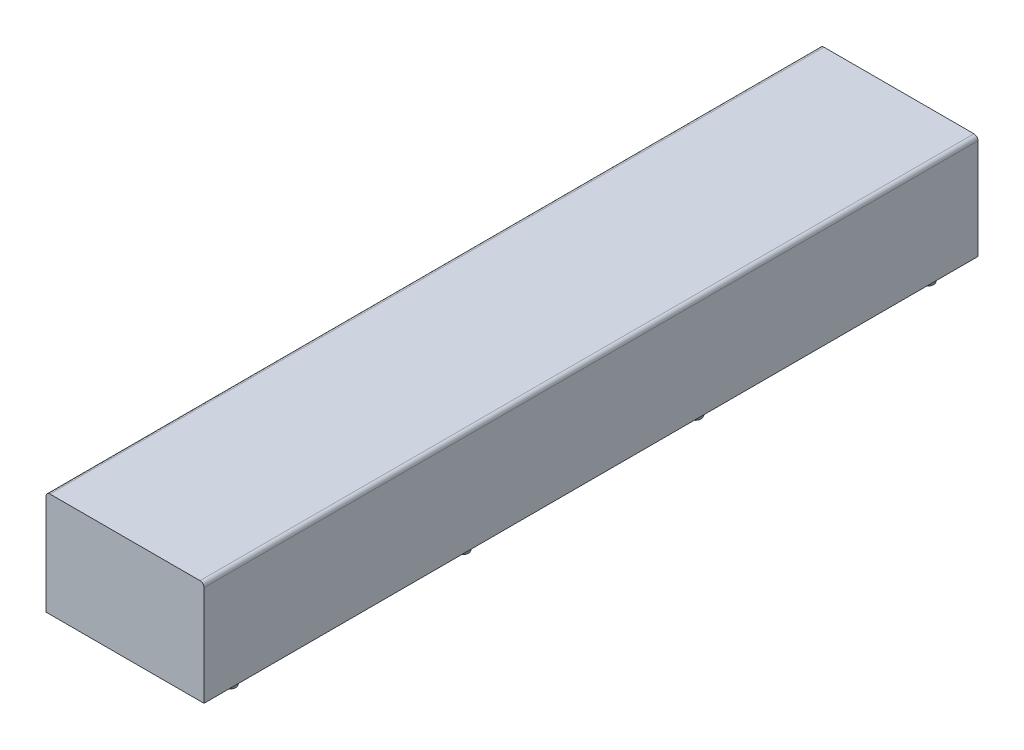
ISO-10303-21;
HEADER;
FILE_DESCRIPTION(('STEP AP214'),'2;1');
FILE_NAME('part.step','',(''),(''),'','','');
FILE_SCHEMA(('AUTOMOTIVE_DESIGN { 1 0 10303 214 1 1 1 1 }'));
ENDSEC;
DATA;
#1=APPLICATION_CONTEXT('core data for automotive mechanical design processes');
#2=APPLICATION_PROTOCOL_DEFINITION('international standard','automotive_design',2000,#1);
#3=PRODUCT_CONTEXT('',#1,'mechanical');
#4=PRODUCT('Part','Part','',(#3));
#5=PRODUCT_RELATED_PRODUCT_CATEGORY('part','',(#4));
#6=PRODUCT_DEFINITION_FORMATION('','',#4);
#7=PRODUCT_DEFINITION_CONTEXT('part definition',#1,'design');
#8=PRODUCT_DEFINITION('design','',#6,#7);
#9=PRODUCT_DEFINITION_SHAPE('','',#8);
#10=(LENGTH_UNIT() NAMED_UNIT(*) SI_UNIT(.MILLI.,.METRE.));
#11=(NAMED_UNIT(*) PLANE_ANGLE_UNIT() SI_UNIT($,.RADIAN.));
#12=(NAMED_UNIT(*) SI_UNIT($,.STERADIAN.) SOLID_ANGLE_UNIT());
#13=UNCERTAINTY_MEASURE_WITH_UNIT(LENGTH_MEASURE(1.E-05),#10,'distance_accuracy_value','');
#14=(GEOMETRIC_REPRESENTATION_CONTEXT(3) GLOBAL_UNCERTAINTY_ASSIGNED_CONTEXT((#13)) GLOBAL_UNIT_ASSIGNED_CONTEXT((#10,
#11,#12)) REPRESENTATION_CONTEXT('',''));
#15=CARTESIAN_POINT('',(0.,0.,0.));
#16=DIRECTION('',(0.,0.,1.));
#17=DIRECTION('',(1.,0.,0.));
#18=AXIS2_PLACEMENT_3D('',#15,#16,#17);
#19=CARTESIAN_POINT('',(-85.0000000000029,-130.,73.1821378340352));
#20=DIRECTION('',(0.,1.,0.));
#21=DIRECTION('',(0.,0.,-1.));
#22=AXIS2_PLACEMENT_3D('',#19,#20,#21);
#23=CONICAL_SURFACE('',#22,10.,0.349065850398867);
#24=CARTESIAN_POINT('',(-85.0000000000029,-140.,73.1821378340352));
#25=DIRECTION('',(0.,-1.,0.));
#26=DIRECTION('',(0.,0.,-1.));
#27=AXIS2_PLACEMENT_3D('',#24,#25,#26);
#28=CIRCLE('',#27,6.36029765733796);
#29=CARTESIAN_POINT('',(-85.0000000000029,-140.,66.8218401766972));
#30=VERTEX_POINT('',#29);
#31=EDGE_CURVE('E11',#30,#30,#28,.T.);
#32=ORIENTED_EDGE('',*,*,#31,.F.);
#33=EDGE_LOOP('',(#32));
#34=FACE_BOUND('',#33,.T.);
#35=CARTESIAN_POINT('',(-85.0000000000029,-130.,73.1821378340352));
#36=DIRECTION('',(0.,-1.,0.));
#37=DIRECTION('',(0.,0.,-1.));
#38=AXIS2_PLACEMENT_3D('',#35,#36,#37);
#39=CIRCLE('',#38,10.);
#40=CARTESIAN_POINT('',(-85.0000000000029,-130.,63.1821378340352));
#41=VERTEX_POINT('',#40);
#42=EDGE_CURVE('E48',#41,#41,#39,.T.);
#43=ORIENTED_EDGE('',*,*,#42,.T.);
#44=EDGE_LOOP('',(#43));
#45=FACE_BOUND('',#44,.T.);
#46=ADVANCED_FACE('F42',(#34,#45),#23,.T.);
#47=CARTESIAN_POINT('',(-85.0000000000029,-140.,73.1821378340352));
#48=DIRECTION('',(0.,-1.,0.));
#49=DIRECTION('',(0.,0.,-1.));
#50=AXIS2_PLACEMENT_3D('',#47,#48,#49);
#51=PLANE('',#50);
#52=ORIENTED_EDGE('',*,*,#31,.T.);
#53=EDGE_LOOP('',(#52));
#54=FACE_BOUND('',#53,.T.);
#55=ADVANCED_FACE('F57',(#54),#51,.T.);
#56=CARTESIAN_POINT('',(-85.0000000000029,-130.,73.1821378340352));
#57=DIRECTION('',(0.,-1.,0.));
#58=DIRECTION('',(0.,0.,-1.));
#59=AXIS2_PLACEMENT_3D('',#56,#57,#58);
#60=PLANE('',#59);
#61=ORIENTED_EDGE('',*,*,#42,.F.);
#62=EDGE_LOOP('',(#61));
#63=FACE_BOUND('',#62,.T.);
#64=ADVANCED_FACE('F55',(#63),#60,.F.);
#65=CLOSED_SHELL('',(#46,#55,#64));
#66=MANIFOLD_SOLID_BREP('B2',#65);
#67=CARTESIAN_POINT('',(84.9999999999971,-130.,73.1821378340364));
#68=DIRECTION('',(0.,1.,0.));
#69=DIRECTION('',(0.,0.,-1.));
#70=AXIS2_PLACEMENT_3D('',#67,#68,#69);
#71=CONICAL_SURFACE('',#70,10.,0.349065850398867);
#72=CARTESIAN_POINT('',(84.9999999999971,-140.,73.1821378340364));
#73=DIRECTION('',(0.,-1.,0.));
#74=DIRECTION('',(0.,0.,-1.));
#75=AXIS2_PLACEMENT_3D('',#72,#73,#74);
#76=CIRCLE('',#75,6.36029765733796);
#77=CARTESIAN_POINT('',(84.9999999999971,-140.,66.8218401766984));
#78=VERTEX_POINT('',#77);
#79=EDGE_CURVE('E41',#78,#78,#76,.T.);
#80=ORIENTED_EDGE('',*,*,#79,.F.);
#81=EDGE_LOOP('',(#80));
#82=FACE_BOUND('',#81,.T.);
#83=CARTESIAN_POINT('',(84.9999999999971,-130.,73.1821378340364));
#84=DIRECTION('',(0.,-1.,0.));
#85=DIRECTION('',(0.,0.,-1.));
#86=AXIS2_PLACEMENT_3D('',#83,#84,#85);
#87=CIRCLE('',#86,10.);
#88=CARTESIAN_POINT('',(84.9999999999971,-130.,63.1821378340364));
#89=VERTEX_POINT('',#88);
#90=EDGE_CURVE('E97',#89,#89,#87,.T.);
#91=ORIENTED_EDGE('',*,*,#90,.T.);
#92=EDGE_LOOP('',(#91));
#93=FACE_BOUND('',#92,.T.);
#94=ADVANCED_FACE('F91',(#82,#93),#71,.T.);
#95=CARTESIAN_POINT('',(84.9999999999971,-140.,73.1821378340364));
#96=DIRECTION('',(0.,-1.,0.));
#97=DIRECTION('',(0.,0.,-1.));
#98=AXIS2_PLACEMENT_3D('',#95,#96,#97);
#99=PLANE('',#98);
#100=ORIENTED_EDGE('',*,*,#79,.T.);
#101=EDGE_LOOP('',(#100));
#102=FACE_BOUND('',#101,.T.);
#103=ADVANCED_FACE('F106',(#102),#99,.T.);
#104=CARTESIAN_POINT('',(84.9999999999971,-130.,73.1821378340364));
#105=DIRECTION('',(0.,-1.,0.));
#106=DIRECTION('',(0.,0.,-1.));
#107=AXIS2_PLACEMENT_3D('',#104,#105,#106);
#108=PLANE('',#107);
#109=ORIENTED_EDGE('',*,*,#90,.F.);
#110=EDGE_LOOP('',(#109));
#111=FACE_BOUND('',#110,.T.);
#112=ADVANCED_FACE('F104',(#111),#108,.F.);
#113=CLOSED_SHELL('',(#94,#103,#112));
#114=MANIFOLD_SOLID_BREP('B6',#113);
#115=CARTESIAN_POINT('',(-85.0000000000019,-130.,-216.817862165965));
#116=DIRECTION('',(0.,1.,0.));
#117=DIRECTION('',(0.,0.,-1.));
#118=AXIS2_PLACEMENT_3D('',#115,#116,#117);
#119=CONICAL_SURFACE('',#118,10.,0.349065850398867);
#120=CARTESIAN_POINT('',(-85.0000000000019,-140.,-216.817862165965));
#121=DIRECTION('',(0.,-1.,0.));
#122=DIRECTION('',(0.,0.,-1.));
#123=AXIS2_PLACEMENT_3D('',#120,#121,#122);
#124=CIRCLE('',#123,6.36029765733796);
#125=CARTESIAN_POINT('',(-85.0000000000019,-140.,-223.178159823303));
#126=VERTEX_POINT('',#125);
#127=EDGE_CURVE('E90',#126,#126,#124,.T.);
#128=ORIENTED_EDGE('',*,*,#127,.F.);
#129=EDGE_LOOP('',(#128));
#130=FACE_BOUND('',#129,.T.);
#131=CARTESIAN_POINT('',(-85.0000000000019,-130.,-216.817862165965));
#132=DIRECTION('',(0.,-1.,0.));
#133=DIRECTION('',(0.,0.,-1.));
#134=AXIS2_PLACEMENT_3D('',#131,#132,#133);
#135=CIRCLE('',#134,10.);
#136=CARTESIAN_POINT('',(-85.0000000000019,-130.,-226.817862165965));
#137=VERTEX_POINT('',#136);
#138=EDGE_CURVE('E146',#137,#137,#135,.T.);
#139=ORIENTED_EDGE('',*,*,#138,.T.);
#140=EDGE_LOOP('',(#139));
#141=FACE_BOUND('',#140,.T.);
#142=ADVANCED_FACE('F140',(#130,#141),#119,.T.);
#143=CARTESIAN_POINT('',(-85.0000000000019,-140.,-216.817862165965));
#144=DIRECTION('',(0.,-1.,0.));
#145=DIRECTION('',(0.,0.,-1.));
#146=AXIS2_PLACEMENT_3D('',#143,#144,#145);
#147=PLANE('',#146);
#148=ORIENTED_EDGE('',*,*,#127,.T.);
#149=EDGE_LOOP('',(#148));
#150=FACE_BOUND('',#149,.T.);
#151=ADVANCED_FACE('F155',(#150),#147,.T.);
#152=CARTESIAN_POINT('',(-85.0000000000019,-130.,-216.817862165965));
#153=DIRECTION('',(0.,-1.,0.));
#154=DIRECTION('',(0.,0.,-1.));
#155=AXIS2_PLACEMENT_3D('',#152,#153,#154);
#156=PLANE('',#155);
#157=ORIENTED_EDGE('',*,*,#138,.F.);
#158=EDGE_LOOP('',(#157));
#159=FACE_BOUND('',#158,.T.);
#160=ADVANCED_FACE('F153',(#159),#156,.F.);
#161=CLOSED_SHELL('',(#142,#151,#160));
#162=MANIFOLD_SOLID_BREP('B36',#161);
#163=CARTESIAN_POINT('',(84.9999999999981,-130.,-216.817862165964));
#164=DIRECTION('',(0.,1.,0.));
#165=DIRECTION('',(0.,0.,-1.));
#166=AXIS2_PLACEMENT_3D('',#163,#164,#165);
#167=CONICAL_SURFACE('',#166,10.,0.349065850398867);
#168=CARTESIAN_POINT('',(84.9999999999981,-140.,-216.817862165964));
#169=DIRECTION('',(0.,-1.,0.));
#170=DIRECTION('',(0.,0.,-1.));
#171=AXIS2_PLACEMENT_3D('',#168,#169,#170);
#172=CIRCLE('',#171,6.36029765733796);
#173=CARTESIAN_POINT('',(84.9999999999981,-140.,-223.178159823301));
#174=VERTEX_POINT('',#173);
#175=EDGE_CURVE('E139',#174,#174,#172,.T.);
#176=ORIENTED_EDGE('',*,*,#175,.F.);
#177=EDGE_LOOP('',(#176));
#178=FACE_BOUND('',#177,.T.);
#179=CARTESIAN_POINT('',(84.9999999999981,-130.,-216.817862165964));
#180=DIRECTION('',(0.,-1.,0.));
#181=DIRECTION('',(0.,0.,-1.));
#182=AXIS2_PLACEMENT_3D('',#179,#180,#181);
#183=CIRCLE('',#182,10.);
#184=CARTESIAN_POINT('',(84.9999999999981,-130.,-226.817862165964));
#185=VERTEX_POINT('',#184);
#186=EDGE_CURVE('E195',#185,#185,#183,.T.);
#187=ORIENTED_EDGE('',*,*,#186,.T.);
#188=EDGE_LOOP('',(#187));
#189=FACE_BOUND('',#188,.T.);
#190=ADVANCED_FACE('F189',(#178,#189),#167,.T.);
#191=CARTESIAN_POINT('',(84.9999999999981,-140.,-216.817862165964));
#192=DIRECTION('',(0.,-1.,0.));
#193=DIRECTION('',(0.,0.,-1.));
#194=AXIS2_PLACEMENT_3D('',#191,#192,#193);
#195=PLANE('',#194);
#196=ORIENTED_EDGE('',*,*,#175,.T.);
#197=EDGE_LOOP('',(#196));
#198=FACE_BOUND('',#197,.T.);
#199=ADVANCED_FACE('F204',(#198),#195,.T.);
#200=CARTESIAN_POINT('',(84.9999999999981,-130.,-216.817862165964));
#201=DIRECTION('',(0.,-1.,0.));
#202=DIRECTION('',(0.,0.,-1.));
#203=AXIS2_PLACEMENT_3D('',#200,#201,#202);
#204=PLANE('',#203);
#205=ORIENTED_EDGE('',*,*,#186,.F.);
#206=EDGE_LOOP('',(#205));
#207=FACE_BOUND('',#206,.T.);
#208=ADVANCED_FACE('F202',(#207),#204,.F.);
#209=CLOSED_SHELL('',(#190,#199,#208));
#210=MANIFOLD_SOLID_BREP('B85',#209);
#211=CARTESIAN_POINT('',(-85.0000000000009,-130.,-506.817862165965));
#212=DIRECTION('',(0.,1.,0.));
#213=DIRECTION('',(0.,0.,-1.));
#214=AXIS2_PLACEMENT_3D('',#211,#212,#213);
#215=CONICAL_SURFACE('',#214,10.,0.349065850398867);
#216=CARTESIAN_POINT('',(-85.0000000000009,-140.,-506.817862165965));
#217=DIRECTION('',(0.,-1.,0.));
#218=DIRECTION('',(0.,0.,-1.));
#219=AXIS2_PLACEMENT_3D('',#216,#217,#218);
#220=CIRCLE('',#219,6.36029765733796);
#221=CARTESIAN_POINT('',(-85.0000000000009,-140.,-513.178159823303));
#222=VERTEX_POINT('',#221);
#223=EDGE_CURVE('E188',#222,#222,#220,.T.);
#224=ORIENTED_EDGE('',*,*,#223,.F.);
#225=EDGE_LOOP('',(#224));
#226=FACE_BOUND('',#225,.T.);
#227=CARTESIAN_POINT('',(-85.0000000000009,-130.,-506.817862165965));
#228=DIRECTION('',(0.,-1.,0.));
#229=DIRECTION('',(0.,0.,-1.));
#230=AXIS2_PLACEMENT_3D('',#227,#228,#229);
#231=CIRCLE('',#230,10.);
#232=CARTESIAN_POINT('',(-85.0000000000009,-130.,-516.817862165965));
#233=VERTEX_POINT('',#232);
#234=EDGE_CURVE('E244',#233,#233,#231,.T.);
#235=ORIENTED_EDGE('',*,*,#234,.T.);
#236=EDGE_LOOP('',(#235));
#237=FACE_BOUND('',#236,.T.);
#238=ADVANCED_FACE('F238',(#226,#237),#215,.T.);
#239=CARTESIAN_POINT('',(-85.0000000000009,-140.,-506.817862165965));
#240=DIRECTION('',(0.,-1.,0.));
#241=DIRECTION('',(0.,0.,-1.));
#242=AXIS2_PLACEMENT_3D('',#239,#240,#241);
#243=PLANE('',#242);
#244=ORIENTED_EDGE('',*,*,#223,.T.);
#245=EDGE_LOOP('',(#244));
#246=FACE_BOUND('',#245,.T.);
#247=ADVANCED_FACE('F253',(#246),#243,.T.);
#248=CARTESIAN_POINT('',(-85.0000000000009,-130.,-506.817862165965));
#249=DIRECTION('',(0.,-1.,0.));
#250=DIRECTION('',(0.,0.,-1.));
#251=AXIS2_PLACEMENT_3D('',#248,#249,#250);
#252=PLANE('',#251);
#253=ORIENTED_EDGE('',*,*,#234,.F.);
#254=EDGE_LOOP('',(#253));
#255=FACE_BOUND('',#254,.T.);
#256=ADVANCED_FACE('F251',(#255),#252,.F.);
#257=CLOSED_SHELL('',(#238,#247,#256));
#258=MANIFOLD_SOLID_BREP('B134',#257);
#259=CARTESIAN_POINT('',(84.9999999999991,-130.,-506.817862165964));
#260=DIRECTION('',(0.,1.,0.));
#261=DIRECTION('',(0.,0.,-1.));
#262=AXIS2_PLACEMENT_3D('',#259,#260,#261);
#263=CONICAL_SURFACE('',#262,10.,0.349065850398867);
#264=CARTESIAN_POINT('',(84.9999999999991,-140.,-506.817862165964));
#265=DIRECTION('',(0.,-1.,0.));
#266=DIRECTION('',(0.,0.,-1.));
#267=AXIS2_PLACEMENT_3D('',#264,#265,#266);
#268=CIRCLE('',#267,6.36029765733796);
#269=CARTESIAN_POINT('',(84.9999999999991,-140.,-513.178159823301));
#270=VERTEX_POINT('',#269);
#271=EDGE_CURVE('E237',#270,#270,#268,.T.);
#272=ORIENTED_EDGE('',*,*,#271,.F.);
#273=EDGE_LOOP('',(#272));
#274=FACE_BOUND('',#273,.T.);
#275=CARTESIAN_POINT('',(84.9999999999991,-130.,-506.817862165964));
#276=DIRECTION('',(0.,-1.,0.));
#277=DIRECTION('',(0.,0.,-1.));
#278=AXIS2_PLACEMENT_3D('',#275,#276,#277);
#279=CIRCLE('',#278,10.);
#280=CARTESIAN_POINT('',(84.9999999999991,-130.,-516.817862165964));
#281=VERTEX_POINT('',#280);
#282=EDGE_CURVE('E293',#281,#281,#279,.T.);
#283=ORIENTED_EDGE('',*,*,#282,.T.);
#284=EDGE_LOOP('',(#283));
#285=FACE_BOUND('',#284,.T.);
#286=ADVANCED_FACE('F287',(#274,#285),#263,.T.);
#287=CARTESIAN_POINT('',(84.9999999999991,-140.,-506.817862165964));
#288=DIRECTION('',(0.,-1.,0.));
#289=DIRECTION('',(0.,0.,-1.));
#290=AXIS2_PLACEMENT_3D('',#287,#288,#289);
#291=PLANE('',#290);
#292=ORIENTED_EDGE('',*,*,#271,.T.);
#293=EDGE_LOOP('',(#292));
#294=FACE_BOUND('',#293,.T.);
#295=ADVANCED_FACE('F302',(#294),#291,.T.);
#296=CARTESIAN_POINT('',(84.9999999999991,-130.,-506.817862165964));
#297=DIRECTION('',(0.,-1.,0.));
#298=DIRECTION('',(0.,0.,-1.));
#299=AXIS2_PLACEMENT_3D('',#296,#297,#298);
#300=PLANE('',#299);
#301=ORIENTED_EDGE('',*,*,#282,.F.);
#302=EDGE_LOOP('',(#301));
#303=FACE_BOUND('',#302,.T.);
#304=ADVANCED_FACE('F300',(#303),#300,.F.);
#305=CLOSED_SHELL('',(#286,#295,#304));
#306=MANIFOLD_SOLID_BREP('B183',#305);
#307=CARTESIAN_POINT('',(-84.9999999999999,-130.,-796.817862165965));
#308=DIRECTION('',(0.,1.,0.));
#309=DIRECTION('',(0.,0.,-1.));
#310=AXIS2_PLACEMENT_3D('',#307,#308,#309);
#311=CONICAL_SURFACE('',#310,10.,0.349065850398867);
#312=CARTESIAN_POINT('',(-84.9999999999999,-140.,-796.817862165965));
#313=DIRECTION('',(0.,-1.,0.));
#314=DIRECTION('',(0.,0.,-1.));
#315=AXIS2_PLACEMENT_3D('',#312,#313,#314);
#316=CIRCLE('',#315,6.36029765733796);
#317=CARTESIAN_POINT('',(-84.9999999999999,-140.,-803.178159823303));
#318=VERTEX_POINT('',#317);
#319=EDGE_CURVE('E286',#318,#318,#316,.T.);
#320=ORIENTED_EDGE('',*,*,#319,.F.);
#321=EDGE_LOOP('',(#320));
#322=FACE_BOUND('',#321,.T.);
#323=CARTESIAN_POINT('',(-84.9999999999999,-130.,-796.817862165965));
#324=DIRECTION('',(0.,-1.,0.));
#325=DIRECTION('',(0.,0.,-1.));
#326=AXIS2_PLACEMENT_3D('',#323,#324,#325);
#327=CIRCLE('',#326,10.);
#328=CARTESIAN_POINT('',(-84.9999999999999,-130.,-806.817862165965));
#329=VERTEX_POINT('',#328);
#330=EDGE_CURVE('E342',#329,#329,#327,.T.);
#331=ORIENTED_EDGE('',*,*,#330,.T.);
#332=EDGE_LOOP('',(#331));
#333=FACE_BOUND('',#332,.T.);
#334=ADVANCED_FACE('F336',(#322,#333),#311,.T.);
#335=CARTESIAN_POINT('',(-84.9999999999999,-140.,-796.817862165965));
#336=DIRECTION('',(0.,-1.,0.));
#337=DIRECTION('',(0.,0.,-1.));
#338=AXIS2_PLACEMENT_3D('',#335,#336,#337);
#339=PLANE('',#338);
#340=ORIENTED_EDGE('',*,*,#319,.T.);
#341=EDGE_LOOP('',(#340));
#342=FACE_BOUND('',#341,.T.);
#343=ADVANCED_FACE('F351',(#342),#339,.T.);
#344=CARTESIAN_POINT('',(-84.9999999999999,-130.,-796.817862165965));
#345=DIRECTION('',(0.,-1.,0.));
#346=DIRECTION('',(0.,0.,-1.));
#347=AXIS2_PLACEMENT_3D('',#344,#345,#346);
#348=PLANE('',#347);
#349=ORIENTED_EDGE('',*,*,#330,.F.);
#350=EDGE_LOOP('',(#349));
#351=FACE_BOUND('',#350,.T.);
#352=ADVANCED_FACE('F349',(#351),#348,.F.);
#353=CLOSED_SHELL('',(#334,#343,#352));
#354=MANIFOLD_SOLID_BREP('B232',#353);
#355=CARTESIAN_POINT('',(85.0000000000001,-130.,-796.817862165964));
#356=DIRECTION('',(0.,1.,0.));
#357=DIRECTION('',(0.,0.,-1.));
#358=AXIS2_PLACEMENT_3D('',#355,#356,#357);
#359=CONICAL_SURFACE('',#358,10.,0.349065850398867);
#360=CARTESIAN_POINT('',(85.0000000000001,-140.,-796.817862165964));
#361=DIRECTION('',(0.,-1.,0.));
#362=DIRECTION('',(0.,0.,-1.));
#363=AXIS2_PLACEMENT_3D('',#360,#361,#362);
#364=CIRCLE('',#363,6.36029765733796);
#365=CARTESIAN_POINT('',(85.0000000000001,-140.,-803.178159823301));
#366=VERTEX_POINT('',#365);
#367=EDGE_CURVE('E335',#366,#366,#364,.T.);
#368=ORIENTED_EDGE('',*,*,#367,.F.);
#369=EDGE_LOOP('',(#368));
#370=FACE_BOUND('',#369,.T.);
#371=CARTESIAN_POINT('',(85.0000000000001,-130.,-796.817862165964));
#372=DIRECTION('',(0.,-1.,0.));
#373=DIRECTION('',(0.,0.,-1.));
#374=AXIS2_PLACEMENT_3D('',#371,#372,#373);
#375=CIRCLE('',#374,10.);
#376=CARTESIAN_POINT('',(85.0000000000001,-130.,-806.817862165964));
#377=VERTEX_POINT('',#376);
#378=EDGE_CURVE('E392',#377,#377,#375,.T.);
#379=ORIENTED_EDGE('',*,*,#378,.T.);
#380=EDGE_LOOP('',(#379));
#381=FACE_BOUND('',#380,.T.);
#382=ADVANCED_FACE('F386',(#370,#381),#359,.T.);
#383=CARTESIAN_POINT('',(85.0000000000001,-140.,-796.817862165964));
#384=DIRECTION('',(0.,-1.,0.));
#385=DIRECTION('',(0.,0.,-1.));
#386=AXIS2_PLACEMENT_3D('',#383,#384,#385);
#387=PLANE('',#386);
#388=ORIENTED_EDGE('',*,*,#367,.T.);
#389=EDGE_LOOP('',(#388));
#390=FACE_BOUND('',#389,.T.);
#391=ADVANCED_FACE('F401',(#390),#387,.T.);
#392=CARTESIAN_POINT('',(85.0000000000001,-130.,-796.817862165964));
#393=DIRECTION('',(0.,-1.,0.));
#394=DIRECTION('',(0.,0.,-1.));
#395=AXIS2_PLACEMENT_3D('',#392,#393,#394);
#396=PLANE('',#395);
#397=ORIENTED_EDGE('',*,*,#378,.F.);
#398=EDGE_LOOP('',(#397));
#399=FACE_BOUND('',#398,.T.);
#400=ADVANCED_FACE('F399',(#399),#396,.F.);
#401=CLOSED_SHELL('',(#382,#391,#400));
#402=MANIFOLD_SOLID_BREP('B281',#401);
#403=CARTESIAN_POINT('',(98.5,-5.00000000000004,120.));
#404=DIRECTION('',(-1.,0.,0.));
#405=DIRECTION('',(0.,-1.,0.));
#406=AXIS2_PLACEMENT_3D('',#403,#404,#405);
#407=PLANE('',#406);
#408=DIRECTION('',(0.,0.,-1.));
#409=VECTOR('',#408,1.);
#410=CARTESIAN_POINT('',(98.5,-130.,120.));
#411=LINE('',#410,#409);
#412=CARTESIAN_POINT('',(98.5,-130.,120.));
#413=VERTEX_POINT('',#412);
#414=CARTESIAN_POINT('',(98.5,-130.,-845.));
#415=VERTEX_POINT('',#414);
#416=EDGE_CURVE('E497',#413,#415,#411,.T.);
#417=ORIENTED_EDGE('',*,*,#416,.T.);
#418=DIRECTION('',(0.,1.,0.));
#419=VECTOR('',#418,1.);
#420=CARTESIAN_POINT('',(98.5,-5.00000000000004,-845.));
#421=LINE('',#420,#419);
#422=CARTESIAN_POINT('',(98.5,-5.00000000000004,-845.));
#423=VERTEX_POINT('',#422);
#424=EDGE_CURVE('E491',#415,#423,#421,.T.);
#425=ORIENTED_EDGE('',*,*,#424,.T.);
#426=DIRECTION('',(0.,0.,-1.));
#427=VECTOR('',#426,1.);
#428=CARTESIAN_POINT('',(98.5,-5.00000000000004,120.));
#429=LINE('',#428,#427);
#430=CARTESIAN_POINT('',(98.5,-5.00000000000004,120.));
#431=VERTEX_POINT('',#430);
#432=EDGE_CURVE('E384',#431,#423,#429,.T.);
#433=ORIENTED_EDGE('',*,*,#432,.F.);
#434=DIRECTION('',(0.,1.,0.));
#435=VECTOR('',#434,1.);
#436=CARTESIAN_POINT('',(98.5,-5.00000000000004,120.));
#437=LINE('',#436,#435);
#438=EDGE_CURVE('E509',#413,#431,#437,.T.);
#439=ORIENTED_EDGE('',*,*,#438,.F.);
#440=EDGE_LOOP('',(#417,#425,#433,#439));
#441=FACE_BOUND('',#440,.T.);
#442=ADVANCED_FACE('F427',(#441),#407,.F.);
#443=CARTESIAN_POINT('',(93.5,-5.,120.));
#444=DIRECTION('',(0.,0.,-1.));
#445=DIRECTION('',(-1.,0.,0.));
#446=AXIS2_PLACEMENT_3D('',#443,#444,#445);
#447=CYLINDRICAL_SURFACE('',#446,5.);
#448=ORIENTED_EDGE('',*,*,#432,.T.);
#449=CARTESIAN_POINT('',(93.5,-5.,-845.));
#450=DIRECTION('',(0.,0.,1.));
#451=DIRECTION('',(1.,0.,0.));
#452=AXIS2_PLACEMENT_3D('',#449,#450,#451);
#453=CIRCLE('',#452,5.);
#454=CARTESIAN_POINT('',(93.5,0.,-845.));
#455=VERTEX_POINT('',#454);
#456=EDGE_CURVE('E481',#423,#455,#453,.T.);
#457=ORIENTED_EDGE('',*,*,#456,.T.);
#458=DIRECTION('',(0.,0.,-1.));
#459=VECTOR('',#458,1.);
#460=CARTESIAN_POINT('',(93.5,0.,120.));
#461=LINE('',#460,#459);
#462=CARTESIAN_POINT('',(93.5,0.,120.));
#463=VERTEX_POINT('',#462);
#464=EDGE_CURVE('E434',#463,#455,#461,.T.);
#465=ORIENTED_EDGE('',*,*,#464,.F.);
#466=CARTESIAN_POINT('',(93.5,-5.,120.));
#467=DIRECTION('',(0.,0.,1.));
#468=DIRECTION('',(1.,0.,0.));
#469=AXIS2_PLACEMENT_3D('',#466,#467,#468);
#470=CIRCLE('',#469,5.);
#471=EDGE_CURVE('E482',#431,#463,#470,.T.);
#472=ORIENTED_EDGE('',*,*,#471,.F.);
#473=EDGE_LOOP('',(#448,#457,#465,#472));
#474=FACE_BOUND('',#473,.T.);
#475=ADVANCED_FACE('F479',(#474),#447,.T.);
#476=CARTESIAN_POINT('',(-93.5,0.,120.));
#477=DIRECTION('',(0.,-1.,0.));
#478=DIRECTION('',(0.,0.,-1.));
#479=AXIS2_PLACEMENT_3D('',#476,#477,#478);
#480=PLANE('',#479);
#481=ORIENTED_EDGE('',*,*,#464,.T.);
#482=DIRECTION('',(-1.,0.,0.));
#483=VECTOR('',#482,1.);
#484=CARTESIAN_POINT('',(-93.5,0.,-845.));
#485=LINE('',#484,#483);
#486=CARTESIAN_POINT('',(-93.5,0.,-845.));
#487=VERTEX_POINT('',#486);
#488=EDGE_CURVE('E495',#455,#487,#485,.T.);
#489=ORIENTED_EDGE('',*,*,#488,.T.);
#490=DIRECTION('',(0.,0.,-1.));
#491=VECTOR('',#490,1.);
#492=CARTESIAN_POINT('',(-93.5,0.,120.));
#493=LINE('',#492,#491);
#494=CARTESIAN_POINT('',(-93.5,0.,120.));
#495=VERTEX_POINT('',#494);
#496=EDGE_CURVE('E523',#495,#487,#493,.T.);
#497=ORIENTED_EDGE('',*,*,#496,.F.);
#498=DIRECTION('',(-1.,0.,0.));
#499=VECTOR('',#498,1.);
#500=CARTESIAN_POINT('',(-93.5,0.,120.));
#501=LINE('',#500,#499);
#502=EDGE_CURVE('E512',#463,#495,#501,.T.);
#503=ORIENTED_EDGE('',*,*,#502,.F.);
#504=EDGE_LOOP('',(#481,#489,#497,#503));
#505=FACE_BOUND('',#504,.T.);
#506=ADVANCED_FACE('F526',(#505),#480,.F.);
#507=CARTESIAN_POINT('',(-93.5,-5.,120.));
#508=DIRECTION('',(0.,0.,-1.));
#509=DIRECTION('',(-1.,0.,0.));
#510=AXIS2_PLACEMENT_3D('',#507,#508,#509);
#511=CYLINDRICAL_SURFACE('',#510,5.);
#512=ORIENTED_EDGE('',*,*,#496,.T.);
#513=CARTESIAN_POINT('',(-93.5,-5.,-845.));
#514=DIRECTION('',(0.,0.,1.));
#515=DIRECTION('',(-1.,0.,0.));
#516=AXIS2_PLACEMENT_3D('',#513,#514,#515);
#517=CIRCLE('',#516,5.);
#518=CARTESIAN_POINT('',(-98.5,-5.00000000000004,-845.));
#519=VERTEX_POINT('',#518);
#520=EDGE_CURVE('E501',#487,#519,#517,.T.);
#521=ORIENTED_EDGE('',*,*,#520,.T.);
#522=DIRECTION('',(0.,0.,-1.));
#523=VECTOR('',#522,1.);
#524=CARTESIAN_POINT('',(-98.5,-5.00000000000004,120.));
#525=LINE('',#524,#523);
#526=CARTESIAN_POINT('',(-98.5,-5.00000000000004,120.));
#527=VERTEX_POINT('',#526);
#528=EDGE_CURVE('E521',#527,#519,#525,.T.);
#529=ORIENTED_EDGE('',*,*,#528,.F.);
#530=CARTESIAN_POINT('',(-93.5,-5.,120.));
#531=DIRECTION('',(0.,0.,1.));
#532=DIRECTION('',(-1.,0.,0.));
#533=AXIS2_PLACEMENT_3D('',#530,#531,#532);
#534=CIRCLE('',#533,5.);
#535=EDGE_CURVE('E514',#495,#527,#534,.T.);
#536=ORIENTED_EDGE('',*,*,#535,.F.);
#537=EDGE_LOOP('',(#512,#521,#529,#536));
#538=FACE_BOUND('',#537,.T.);
#539=ADVANCED_FACE('F532',(#538),#511,.T.);
#540=CARTESIAN_POINT('',(-98.5,-5.00000000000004,120.));
#541=DIRECTION('',(1.,0.,0.));
#542=DIRECTION('',(0.,1.,0.));
#543=AXIS2_PLACEMENT_3D('',#540,#541,#542);
#544=PLANE('',#543);
#545=ORIENTED_EDGE('',*,*,#528,.T.);
#546=DIRECTION('',(0.,-1.,0.));
#547=VECTOR('',#546,1.);
#548=CARTESIAN_POINT('',(-98.5,-5.00000000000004,-845.));
#549=LINE('',#548,#547);
#550=CARTESIAN_POINT('',(-98.5,-130.,-845.));
#551=VERTEX_POINT('',#550);
#552=EDGE_CURVE('E504',#519,#551,#549,.T.);
#553=ORIENTED_EDGE('',*,*,#552,.T.);
#554=DIRECTION('',(0.,0.,-1.));
#555=VECTOR('',#554,1.);
#556=CARTESIAN_POINT('',(-98.5,-130.,120.));
#557=LINE('',#556,#555);
#558=CARTESIAN_POINT('',(-98.5,-130.,120.));
#559=VERTEX_POINT('',#558);
#560=EDGE_CURVE('E519',#559,#551,#557,.T.);
#561=ORIENTED_EDGE('',*,*,#560,.F.);
#562=DIRECTION('',(0.,-1.,0.));
#563=VECTOR('',#562,1.);
#564=CARTESIAN_POINT('',(-98.5,-5.00000000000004,120.));
#565=LINE('',#564,#563);
#566=EDGE_CURVE('E446',#527,#559,#565,.T.);
#567=ORIENTED_EDGE('',*,*,#566,.F.);
#568=EDGE_LOOP('',(#545,#553,#561,#567));
#569=FACE_BOUND('',#568,.T.);
#570=ADVANCED_FACE('F535',(#569),#544,.F.);
#571=CARTESIAN_POINT('',(-98.5,-130.,120.));
#572=DIRECTION('',(0.,1.,0.));
#573=DIRECTION('',(0.,0.,1.));
#574=AXIS2_PLACEMENT_3D('',#571,#572,#573);
#575=PLANE('',#574);
#576=ORIENTED_EDGE('',*,*,#560,.T.);
#577=DIRECTION('',(1.,0.,0.));
#578=VECTOR('',#577,1.);
#579=CARTESIAN_POINT('',(-98.5,-130.,-845.));
#580=LINE('',#579,#578);
#581=EDGE_CURVE('E507',#551,#415,#580,.T.);
#582=ORIENTED_EDGE('',*,*,#581,.T.);
#583=ORIENTED_EDGE('',*,*,#416,.F.);
#584=DIRECTION('',(1.,0.,0.));
#585=VECTOR('',#584,1.);
#586=CARTESIAN_POINT('',(-98.5,-130.,120.));
#587=LINE('',#586,#585);
#588=EDGE_CURVE('E441',#559,#413,#587,.T.);
#589=ORIENTED_EDGE('',*,*,#588,.F.);
#590=EDGE_LOOP('',(#576,#582,#583,#589));
#591=FACE_BOUND('',#590,.T.);
#592=ADVANCED_FACE('F537',(#591),#575,.F.);
#593=CARTESIAN_POINT('',(-93.5,-5.,120.));
#594=DIRECTION('',(0.,0.,-1.));
#595=DIRECTION('',(-1.,0.,0.));
#596=AXIS2_PLACEMENT_3D('',#593,#594,#595);
#597=PLANE('',#596);
#598=ORIENTED_EDGE('',*,*,#438,.T.);
#599=ORIENTED_EDGE('',*,*,#471,.T.);
#600=ORIENTED_EDGE('',*,*,#502,.T.);
#601=ORIENTED_EDGE('',*,*,#535,.T.);
#602=ORIENTED_EDGE('',*,*,#566,.T.);
#603=ORIENTED_EDGE('',*,*,#588,.T.);
#604=EDGE_LOOP('',(#598,#599,#600,#601,#602,#603));
#605=FACE_BOUND('',#604,.T.);
#606=ADVANCED_FACE('F529',(#605),#597,.F.);
#607=CARTESIAN_POINT('',(-93.5,-5.,-845.));
#608=DIRECTION('',(0.,0.,-1.));
#609=DIRECTION('',(-1.,0.,0.));
#610=AXIS2_PLACEMENT_3D('',#607,#608,#609);
#611=PLANE('',#610);
#612=ORIENTED_EDGE('',*,*,#424,.F.);
#613=ORIENTED_EDGE('',*,*,#581,.F.);
#614=ORIENTED_EDGE('',*,*,#552,.F.);
#615=ORIENTED_EDGE('',*,*,#520,.F.);
#616=ORIENTED_EDGE('',*,*,#488,.F.);
#617=ORIENTED_EDGE('',*,*,#456,.F.);
#618=EDGE_LOOP('',(#612,#613,#614,#615,#616,#617));
#619=FACE_BOUND('',#618,.T.);
#620=ADVANCED_FACE('F489',(#619),#611,.T.);
#621=CLOSED_SHELL('',(#442,#475,#506,#539,#570,#592,#606,#620));
#622=MANIFOLD_SOLID_BREP('B330',#621);
#623=ADVANCED_BREP_SHAPE_REPRESENTATION('',(#18,#66,#114,#162,#210,#258,#306,#354,#402,#622),#14);
#624=SHAPE_DEFINITION_REPRESENTATION(#9,#623);
ENDSEC;
END-ISO-10303-21;
